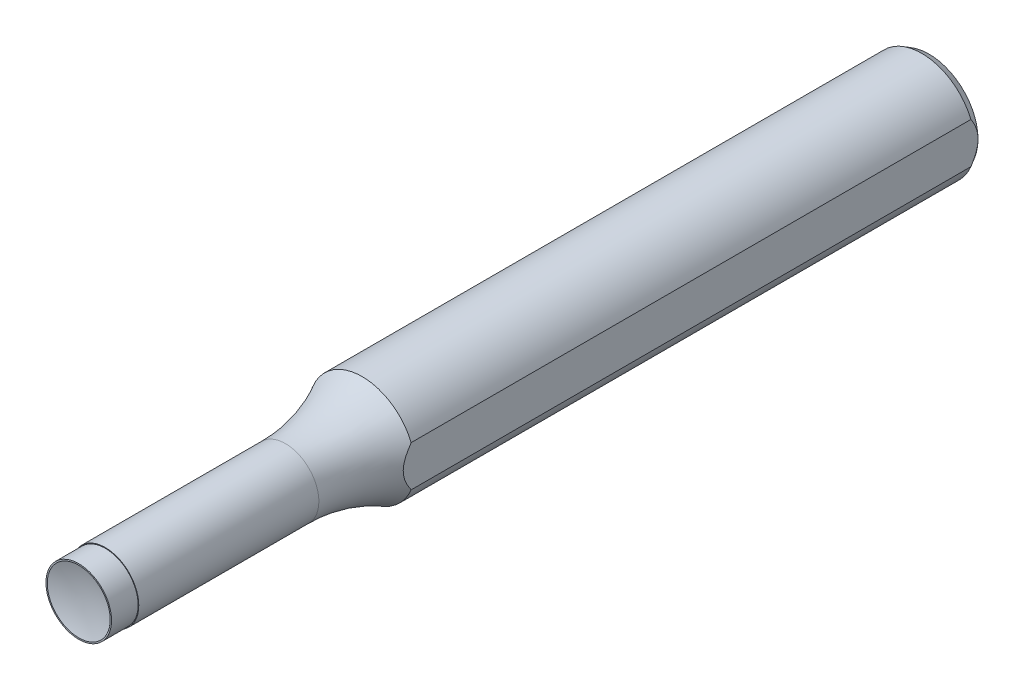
from build123d import *

# Parameters (mm, degrees)
SKETCH1_R           = 7.94
BOSS_EXTRUDE1_DEPTH = 127
SKETCH2_OUTSIDE_W   = 43.674
SKETCH2_OUTSIDE_H   = 43.674
SKETCH2_OUTSIDE_R   = 5
CUT_EXTRUDE1_DEPTH  = 42.333333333
SKETCH3_OUTSIDE_W   = 43.674
SKETCH3_OUTSIDE_H   = 43.674
SKETCH3_OUTSIDE_R   = 4.9
CUT_EXTRUDE2_DEPTH  = 3.97
CHAMFER1_SIZE       = 1.058666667
CHAMFER1_SIZE2      = 0.611221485
SKETCH7_W           = 6.109862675
SKETCH7_H           = 6.109862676
CUT_EXTRUDE3_DEPTH  = 128.495439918


with BuildPart() as part:
    # Sketch1 → Boss-Extrude1 (new body)
    with BuildSketch(Plane.XY):
        Circle(SKETCH1_R)
    extrude(amount=-BOSS_EXTRUDE1_DEPTH)

    # Sketch2 outside → Cut-Extrude1 (cut)
    with BuildSketch(Plane.XY):
        Rectangle(SKETCH2_OUTSIDE_W, SKETCH2_OUTSIDE_H)
        Circle(SKETCH2_OUTSIDE_R, mode=Mode.SUBTRACT)
    extrude(amount=-CUT_EXTRUDE1_DEPTH, mode=Mode.SUBTRACT)

    # Sketch3 outside → Cut-Extrude2 (cut)
    with BuildSketch(Plane.XY):
        Rectangle(SKETCH3_OUTSIDE_W, SKETCH3_OUTSIDE_H)
        Circle(SKETCH3_OUTSIDE_R, mode=Mode.SUBTRACT)
    extrude(amount=-CUT_EXTRUDE2_DEPTH, mode=Mode.SUBTRACT)

    # Sketch4 → Cut-Revolve1 (revolve, cut)
    with BuildSketch(Plane(origin=(0, 0, 0), x_dir=(0, 0, -1), z_dir=(1, 0, 0)), mode=Mode.PRIVATE) as cut_revolve1_sk:
        with BuildLine():
            Line((0, 0), (0, 4.7))
            ThreePointArc((0, 4.7), (0.532592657, 2.376772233), (0.711466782, 0))
            Line((0.711466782, 0), (0, 0))
        make_face()
    revolve(cut_revolve1_sk.sketch.rotate(Axis((0, 0, 0), (0, 0, -1)), 180), axis=Axis((0, 0, 0), (0, 0, -1)), mode=Mode.SUBTRACT)

    # Chamfer1
    chamfer1_edges = [part.edges().sort_by_distance(p)[0] for p in [
        (-7.94, 0, -127),
    ]]
    chamfer1_side = [part.faces().sort_by_distance(p)[0] for p in [
        (-7.94, 0, -84.666666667),
    ]]
    chamfer(chamfer1_edges, length=CHAMFER1_SIZE, length2=CHAMFER1_SIZE2, reference=chamfer1_side[0])

    # Sketch5 → Revolve1 (revolve)
    with BuildSketch(Plane(origin=(0, 0, 0), x_dir=(0, 0, -1), z_dir=(1, 0, 0)), mode=Mode.PRIVATE) as revolve1_sk:
        with BuildLine():
            Line((42.333333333, 0), (30.86956432, 0))
            Line((30.86956432, 0), (30.86956432, 5))
            ThreePointArc((30.86956432, 5), (36.786945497, 5.746703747), (42.333333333, 7.94))
            Line((42.333333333, 7.94), (42.333333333, 0))
        make_face()
    revolve(revolve1_sk.sketch.rotate(Axis((0, 0, -42.333333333), (0, 0, 1)), 270), axis=Axis((0, 0, -42.333333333), (0, 0, 1)))

    # Sketch7 → Cut-Extrude3 (cut, through all)
    with BuildSketch(Plane(origin=(0, 0, -127), x_dir=(-1, 0, 0), z_dir=(0, 0, -1))):
        with Locations((-10.383709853, 0)):
            Rectangle(SKETCH7_W, SKETCH7_H)
    extrude(amount=-CUT_EXTRUDE3_DEPTH, mode=Mode.SUBTRACT)


solid = part.part
